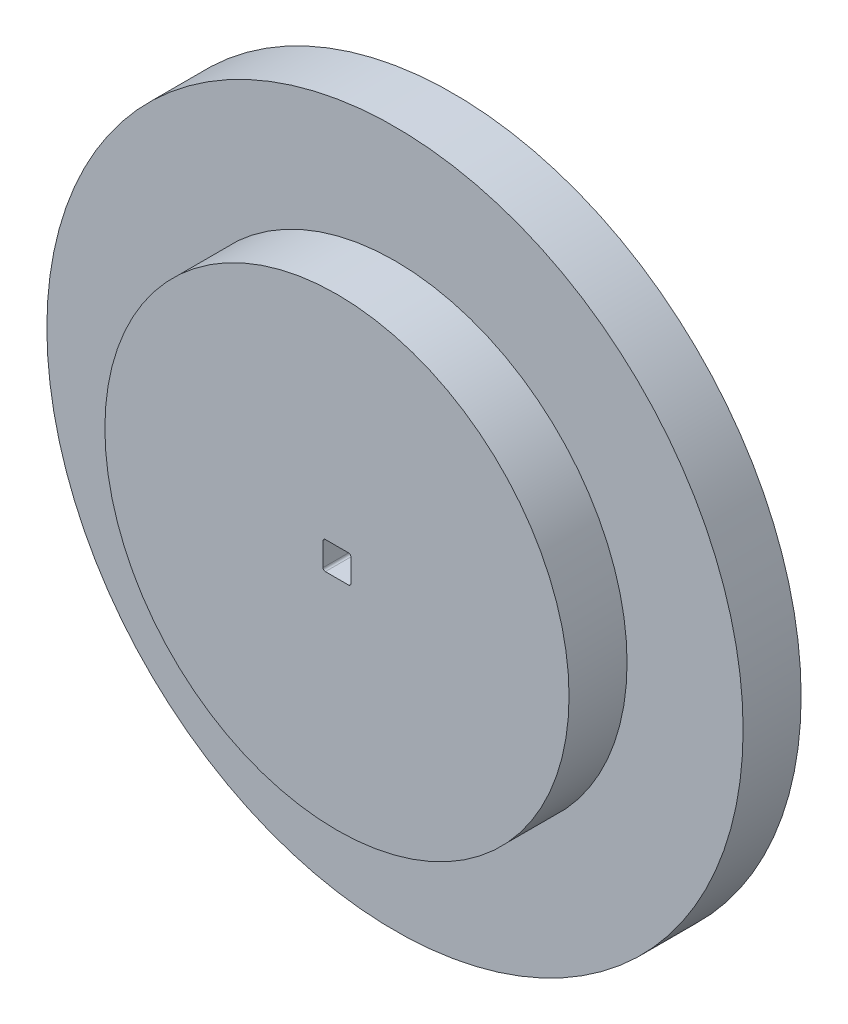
from build123d import *

# Parameters (mm, degrees)
SKETCH1_R           = 38.1
BOSS_EXTRUDE1_DEPTH = 6.35
SKETCH2_R           = 25.4
BOSS_EXTRUDE2_DEPTH = 6.35
SKETCH3_W           = 3.048
SKETCH3_H           = 3.048
CUT_EXTRUDE1_DEPTH  = 56.358016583
FILLET1_R           = 0.254


with BuildPart() as part:
    # Sketch1 → Boss-Extrude1 (new body)
    with BuildSketch(Plane.XY):
        Circle(SKETCH1_R)
    extrude(amount=BOSS_EXTRUDE1_DEPTH)

    # Sketch2 → Boss-Extrude2 (add)
    with BuildSketch(Plane.XY.offset(6.35)):
        Circle(SKETCH2_R)
    extrude(amount=BOSS_EXTRUDE2_DEPTH)

    # Sketch3 → Cut-Extrude1 (cut, through all)
    with BuildSketch(Plane(origin=(0, 0, 0), x_dir=(-1, 0, 0), z_dir=(0, 0, -1))):
        Rectangle(SKETCH3_W, SKETCH3_H)
    extrude(amount=-CUT_EXTRUDE1_DEPTH, mode=Mode.SUBTRACT)

    # Fillet1
    fillet1_edges = [part.edges().sort_by_distance(p)[0] for p in [
        (-1.524, 1.524, 6.35),
        (-1.524, -1.524, 6.35),
        (1.524, -1.524, 6.35),
        (1.524, 1.524, 6.35),
    ]]
    fillet(fillet1_edges, radius=FILLET1_R)


solid = part.part
